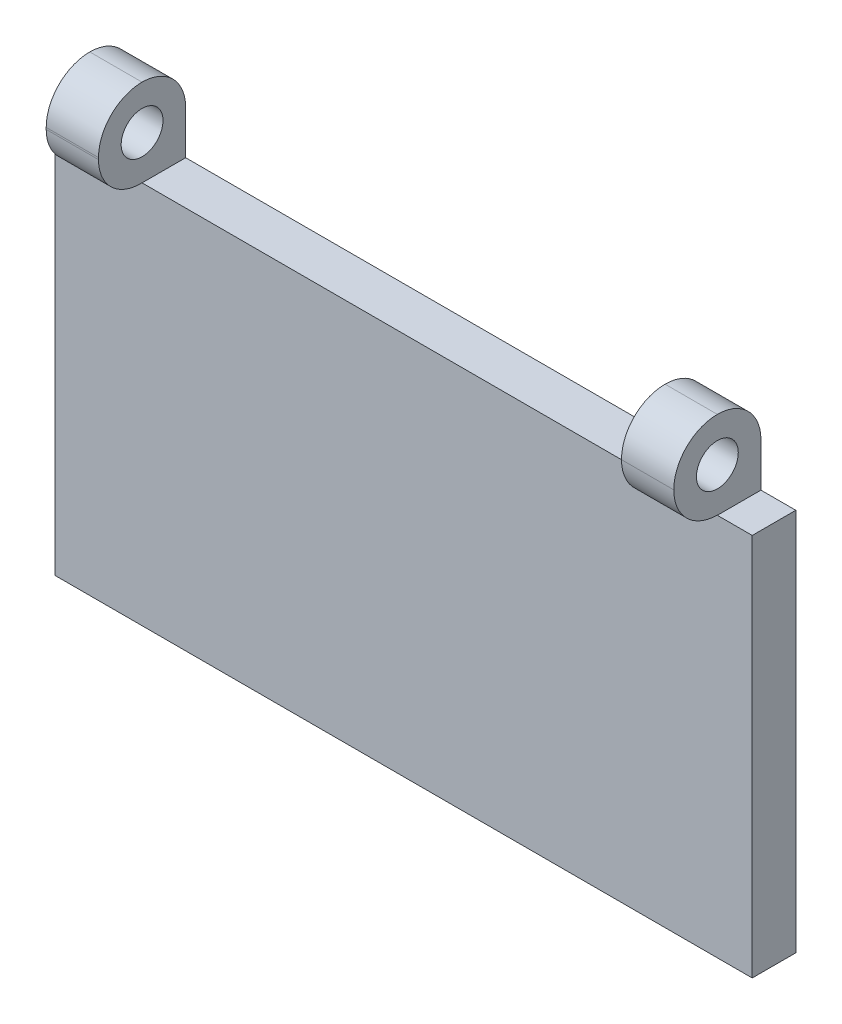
ISO-10303-21;
HEADER;
FILE_DESCRIPTION(('STEP AP214'),'2;1');
FILE_NAME('part.step','',(''),(''),'','','');
FILE_SCHEMA(('AUTOMOTIVE_DESIGN { 1 0 10303 214 1 1 1 1 }'));
ENDSEC;
DATA;
#1=APPLICATION_CONTEXT('core data for automotive mechanical design processes');
#2=APPLICATION_PROTOCOL_DEFINITION('international standard','automotive_design',2000,#1);
#3=PRODUCT_CONTEXT('',#1,'mechanical');
#4=PRODUCT('Part','Part','',(#3));
#5=PRODUCT_RELATED_PRODUCT_CATEGORY('part','',(#4));
#6=PRODUCT_DEFINITION_FORMATION('','',#4);
#7=PRODUCT_DEFINITION_CONTEXT('part definition',#1,'design');
#8=PRODUCT_DEFINITION('design','',#6,#7);
#9=PRODUCT_DEFINITION_SHAPE('','',#8);
#10=(LENGTH_UNIT() NAMED_UNIT(*) SI_UNIT(.MILLI.,.METRE.));
#11=(NAMED_UNIT(*) PLANE_ANGLE_UNIT() SI_UNIT($,.RADIAN.));
#12=(NAMED_UNIT(*) SI_UNIT($,.STERADIAN.) SOLID_ANGLE_UNIT());
#13=UNCERTAINTY_MEASURE_WITH_UNIT(LENGTH_MEASURE(1.E-05),#10,'distance_accuracy_value','');
#14=(GEOMETRIC_REPRESENTATION_CONTEXT(3) GLOBAL_UNCERTAINTY_ASSIGNED_CONTEXT((#13)) GLOBAL_UNIT_ASSIGNED_CONTEXT((#10,
#11,#12)) REPRESENTATION_CONTEXT('',''));
#15=CARTESIAN_POINT('',(0.,0.,0.));
#16=DIRECTION('',(0.,0.,1.));
#17=DIRECTION('',(1.,0.,0.));
#18=AXIS2_PLACEMENT_3D('',#15,#16,#17);
#19=CARTESIAN_POINT('',(18.,22.075,2.5));
#20=DIRECTION('',(-1.,0.,0.));
#21=DIRECTION('',(0.,0.,1.));
#22=AXIS2_PLACEMENT_3D('',#19,#20,#21);
#23=CYLINDRICAL_SURFACE('',#22,1.2);
#24=CARTESIAN_POINT('',(15.,22.075,2.5));
#25=DIRECTION('',(1.,0.,0.));
#26=DIRECTION('',(0.,0.,-1.));
#27=AXIS2_PLACEMENT_3D('',#24,#25,#26);
#28=CIRCLE('',#27,1.2);
#29=CARTESIAN_POINT('',(15.,22.075,1.3));
#30=VERTEX_POINT('',#29);
#31=EDGE_CURVE('E191',#30,#30,#28,.F.);
#32=ORIENTED_EDGE('',*,*,#31,.T.);
#33=EDGE_LOOP('',(#32));
#34=FACE_BOUND('',#33,.T.);
#35=CARTESIAN_POINT('',(18.,22.075,2.5));
#36=DIRECTION('',(1.,0.,0.));
#37=DIRECTION('',(0.,0.,-1.));
#38=AXIS2_PLACEMENT_3D('',#35,#36,#37);
#39=CIRCLE('',#38,1.2);
#40=CARTESIAN_POINT('',(18.,22.075,1.3));
#41=VERTEX_POINT('',#40);
#42=EDGE_CURVE('E301',#41,#41,#39,.F.);
#43=ORIENTED_EDGE('',*,*,#42,.F.);
#44=EDGE_LOOP('',(#43));
#45=FACE_BOUND('',#44,.T.);
#46=ADVANCED_FACE('F36',(#34,#45),#23,.F.);
#47=CARTESIAN_POINT('',(20.,22.075,2.5));
#48=DIRECTION('',(-1.,0.,0.));
#49=DIRECTION('',(0.,-1.,0.));
#50=AXIS2_PLACEMENT_3D('',#47,#48,#49);
#51=CYLINDRICAL_SURFACE('',#50,2.5);
#52=DIRECTION('',(-1.,0.,0.));
#53=VECTOR('',#52,1.);
#54=CARTESIAN_POINT('',(20.,24.575,2.5));
#55=LINE('',#54,#53);
#56=CARTESIAN_POINT('',(18.,24.575,2.5));
#57=VERTEX_POINT('',#56);
#58=CARTESIAN_POINT('',(15.,24.575,2.5));
#59=VERTEX_POINT('',#58);
#60=EDGE_CURVE('E228',#57,#59,#55,.T.);
#61=ORIENTED_EDGE('',*,*,#60,.F.);
#62=CARTESIAN_POINT('',(18.,22.075,2.5));
#63=DIRECTION('',(1.,0.,0.));
#64=DIRECTION('',(0.,0.,-1.));
#65=AXIS2_PLACEMENT_3D('',#62,#63,#64);
#66=CIRCLE('',#65,2.5);
#67=CARTESIAN_POINT('',(18.,22.075,0.));
#68=VERTEX_POINT('',#67);
#69=EDGE_CURVE('E312',#57,#68,#66,.F.);
#70=ORIENTED_EDGE('',*,*,#69,.T.);
#71=DIRECTION('',(-1.,0.,0.));
#72=VECTOR('',#71,1.);
#73=CARTESIAN_POINT('',(0.,22.075,0.));
#74=LINE('',#73,#72);
#75=CARTESIAN_POINT('',(15.,22.075,0.));
#76=VERTEX_POINT('',#75);
#77=EDGE_CURVE('E220',#76,#68,#74,.F.);
#78=ORIENTED_EDGE('',*,*,#77,.F.);
#79=CARTESIAN_POINT('',(15.,22.075,2.5));
#80=DIRECTION('',(1.,0.,0.));
#81=DIRECTION('',(0.,0.,-1.));
#82=AXIS2_PLACEMENT_3D('',#79,#80,#81);
#83=CIRCLE('',#82,2.5);
#84=EDGE_CURVE('E268',#59,#76,#83,.F.);
#85=ORIENTED_EDGE('',*,*,#84,.F.);
#86=EDGE_LOOP('',(#61,#70,#78,#85));
#87=FACE_BOUND('',#86,.T.);
#88=ADVANCED_FACE('F38',(#87),#51,.T.);
#89=CARTESIAN_POINT('',(20.,22.075,2.5));
#90=DIRECTION('',(-1.,0.,0.));
#91=DIRECTION('',(0.,-1.,0.));
#92=AXIS2_PLACEMENT_3D('',#89,#90,#91);
#93=CYLINDRICAL_SURFACE('',#92,2.5);
#94=DIRECTION('',(-1.,0.,0.));
#95=VECTOR('',#94,1.);
#96=CARTESIAN_POINT('',(20.,22.075,5.));
#97=LINE('',#96,#95);
#98=CARTESIAN_POINT('',(18.,22.075,5.));
#99=VERTEX_POINT('',#98);
#100=CARTESIAN_POINT('',(15.,22.075,5.));
#101=VERTEX_POINT('',#100);
#102=EDGE_CURVE('E229',#99,#101,#97,.T.);
#103=ORIENTED_EDGE('',*,*,#102,.F.);
#104=CARTESIAN_POINT('',(18.,22.075,2.5));
#105=DIRECTION('',(1.,0.,0.));
#106=DIRECTION('',(0.,0.,-1.));
#107=AXIS2_PLACEMENT_3D('',#104,#105,#106);
#108=CIRCLE('',#107,2.5);
#109=EDGE_CURVE('E315',#99,#57,#108,.F.);
#110=ORIENTED_EDGE('',*,*,#109,.T.);
#111=ORIENTED_EDGE('',*,*,#60,.T.);
#112=CARTESIAN_POINT('',(15.,22.075,2.5));
#113=DIRECTION('',(1.,0.,0.));
#114=DIRECTION('',(0.,0.,-1.));
#115=AXIS2_PLACEMENT_3D('',#112,#113,#114);
#116=CIRCLE('',#115,2.5);
#117=EDGE_CURVE('E197',#101,#59,#116,.F.);
#118=ORIENTED_EDGE('',*,*,#117,.F.);
#119=EDGE_LOOP('',(#103,#110,#111,#118));
#120=FACE_BOUND('',#119,.T.);
#121=ADVANCED_FACE('F423',(#120),#93,.T.);
#122=CARTESIAN_POINT('',(20.,22.075,2.5));
#123=DIRECTION('',(-1.,0.,0.));
#124=DIRECTION('',(0.,-1.,0.));
#125=AXIS2_PLACEMENT_3D('',#122,#123,#124);
#126=CYLINDRICAL_SURFACE('',#125,2.5);
#127=DIRECTION('',(-1.,0.,0.));
#128=VECTOR('',#127,1.);
#129=CARTESIAN_POINT('',(20.,19.575,2.5));
#130=LINE('',#129,#128);
#131=CARTESIAN_POINT('',(18.,19.575,2.5));
#132=VERTEX_POINT('',#131);
#133=CARTESIAN_POINT('',(15.,19.575,2.5));
#134=VERTEX_POINT('',#133);
#135=EDGE_CURVE('E253',#132,#134,#130,.T.);
#136=ORIENTED_EDGE('',*,*,#135,.F.);
#137=CARTESIAN_POINT('',(18.,22.075,2.5));
#138=DIRECTION('',(1.,0.,0.));
#139=DIRECTION('',(0.,0.,-1.));
#140=AXIS2_PLACEMENT_3D('',#137,#138,#139);
#141=CIRCLE('',#140,2.5);
#142=EDGE_CURVE('E212',#132,#99,#141,.F.);
#143=ORIENTED_EDGE('',*,*,#142,.T.);
#144=ORIENTED_EDGE('',*,*,#102,.T.);
#145=CARTESIAN_POINT('',(15.,22.075,2.5));
#146=DIRECTION('',(1.,0.,0.));
#147=DIRECTION('',(0.,0.,-1.));
#148=AXIS2_PLACEMENT_3D('',#145,#146,#147);
#149=CIRCLE('',#148,2.5);
#150=EDGE_CURVE('E208',#134,#101,#149,.F.);
#151=ORIENTED_EDGE('',*,*,#150,.F.);
#152=EDGE_LOOP('',(#136,#143,#144,#151));
#153=FACE_BOUND('',#152,.T.);
#154=ADVANCED_FACE('F428',(#153),#126,.T.);
#155=CARTESIAN_POINT('',(-18.,22.075,2.5));
#156=DIRECTION('',(1.,0.,0.));
#157=DIRECTION('',(0.,0.,-1.));
#158=AXIS2_PLACEMENT_3D('',#155,#156,#157);
#159=CIRCLE('',#158,1.2);
#160=CARTESIAN_POINT('',(-18.,22.075,1.3));
#161=VERTEX_POINT('',#160);
#162=EDGE_CURVE('E276',#161,#161,#159,.F.);
#163=ORIENTED_EDGE('',*,*,#162,.T.);
#164=EDGE_LOOP('',(#163));
#165=FACE_BOUND('',#164,.T.);
#166=CARTESIAN_POINT('',(-15.,22.075,2.5));
#167=DIRECTION('',(-1.,0.,0.));
#168=DIRECTION('',(0.,0.,1.));
#169=AXIS2_PLACEMENT_3D('',#166,#167,#168);
#170=CIRCLE('',#169,1.2);
#171=CARTESIAN_POINT('',(-15.,22.075,3.7));
#172=VERTEX_POINT('',#171);
#173=EDGE_CURVE('E231',#172,#172,#170,.F.);
#174=ORIENTED_EDGE('',*,*,#173,.T.);
#175=EDGE_LOOP('',(#174));
#176=FACE_BOUND('',#175,.T.);
#177=ADVANCED_FACE('F419',(#165,#176),#23,.F.);
#178=CARTESIAN_POINT('',(20.,-24.575,5.));
#179=DIRECTION('',(-1.,0.,0.));
#180=DIRECTION('',(0.,0.,1.));
#181=AXIS2_PLACEMENT_3D('',#178,#179,#180);
#182=PLANE('',#181);
#183=DIRECTION('',(0.,1.,0.));
#184=VECTOR('',#183,1.);
#185=CARTESIAN_POINT('',(20.,19.575,2.5));
#186=LINE('',#185,#184);
#187=CARTESIAN_POINT('',(20.,-2.4249997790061,2.5));
#188=VERTEX_POINT('',#187);
#189=CARTESIAN_POINT('',(20.,19.5610313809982,2.5));
#190=VERTEX_POINT('',#189);
#191=EDGE_CURVE('E248',#188,#190,#186,.T.);
#192=ORIENTED_EDGE('',*,*,#191,.F.);
#193=DIRECTION('',(0.,0.,-1.));
#194=VECTOR('',#193,1.);
#195=CARTESIAN_POINT('',(20.,-2.4249995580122,5.));
#196=LINE('',#195,#194);
#197=CARTESIAN_POINT('',(20.,-2.4249995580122,0.));
#198=VERTEX_POINT('',#197);
#199=EDGE_CURVE('E60',#188,#198,#196,.T.);
#200=ORIENTED_EDGE('',*,*,#199,.T.);
#201=DIRECTION('',(0.,1.,0.));
#202=VECTOR('',#201,1.);
#203=CARTESIAN_POINT('',(20.,-24.575,0.));
#204=LINE('',#203,#202);
#205=CARTESIAN_POINT('',(20.,19.5610313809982,0.));
#206=VERTEX_POINT('',#205);
#207=EDGE_CURVE('E237',#198,#206,#204,.T.);
#208=ORIENTED_EDGE('',*,*,#207,.T.);
#209=DIRECTION('',(0.,0.,-1.));
#210=VECTOR('',#209,1.);
#211=CARTESIAN_POINT('',(20.,19.5610313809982,0.));
#212=LINE('',#211,#210);
#213=EDGE_CURVE('E322',#190,#206,#212,.T.);
#214=ORIENTED_EDGE('',*,*,#213,.F.);
#215=EDGE_LOOP('',(#192,#200,#208,#214));
#216=FACE_BOUND('',#215,.T.);
#217=ADVANCED_FACE('F405',(#216),#182,.F.);
#218=CARTESIAN_POINT('',(-20.,-24.575,5.));
#219=DIRECTION('',(1.,0.,0.));
#220=DIRECTION('',(0.,0.,-1.));
#221=AXIS2_PLACEMENT_3D('',#218,#219,#220);
#222=PLANE('',#221);
#223=DIRECTION('',(0.,-1.,0.));
#224=VECTOR('',#223,1.);
#225=CARTESIAN_POINT('',(-20.,-24.575,0.));
#226=LINE('',#225,#224);
#227=CARTESIAN_POINT('',(-20.,19.5520831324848,0.));
#228=VERTEX_POINT('',#227);
#229=CARTESIAN_POINT('',(-19.9999997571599,-2.42500000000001,0.));
#230=VERTEX_POINT('',#229);
#231=EDGE_CURVE('E245',#228,#230,#226,.T.);
#232=ORIENTED_EDGE('',*,*,#231,.T.);
#233=DIRECTION('',(0.,0.,1.));
#234=VECTOR('',#233,1.);
#235=CARTESIAN_POINT('',(-19.9999997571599,-2.42500000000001,0.));
#236=LINE('',#235,#234);
#237=CARTESIAN_POINT('',(-19.9999997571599,-2.42500000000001,2.5));
#238=VERTEX_POINT('',#237);
#239=EDGE_CURVE('E329',#230,#238,#236,.T.);
#240=ORIENTED_EDGE('',*,*,#239,.T.);
#241=DIRECTION('',(0.,-1.,0.));
#242=VECTOR('',#241,1.);
#243=CARTESIAN_POINT('',(-19.9999995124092,19.575,2.5));
#244=LINE('',#243,#242);
#245=CARTESIAN_POINT('',(-20.,19.5520831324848,2.5));
#246=VERTEX_POINT('',#245);
#247=EDGE_CURVE('E250',#246,#238,#244,.T.);
#248=ORIENTED_EDGE('',*,*,#247,.F.);
#249=DIRECTION('',(0.,0.,1.));
#250=VECTOR('',#249,1.);
#251=CARTESIAN_POINT('',(-20.,19.5520831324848,0.));
#252=LINE('',#251,#250);
#253=EDGE_CURVE('E298',#228,#246,#252,.T.);
#254=ORIENTED_EDGE('',*,*,#253,.F.);
#255=EDGE_LOOP('',(#232,#240,#248,#254));
#256=FACE_BOUND('',#255,.T.);
#257=ADVANCED_FACE('F346',(#256),#222,.F.);
#258=CARTESIAN_POINT('',(0.,0.,0.));
#259=DIRECTION('',(0.,0.,1.));
#260=DIRECTION('',(1.,0.,0.));
#261=AXIS2_PLACEMENT_3D('',#258,#259,#260);
#262=PLANE('',#261);
#263=ORIENTED_EDGE('',*,*,#207,.F.);
#264=DIRECTION('',(-1.,-1.10496954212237E-08,0.));
#265=VECTOR('',#264,1.);
#266=CARTESIAN_POINT('',(-19.9999997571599,-2.42500000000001,0.));
#267=LINE('',#266,#265);
#268=EDGE_CURVE('E179',#198,#230,#267,.T.);
#269=ORIENTED_EDGE('',*,*,#268,.T.);
#270=ORIENTED_EDGE('',*,*,#231,.F.);
#271=DIRECTION('',(-1.,0.,0.));
#272=VECTOR('',#271,1.);
#273=CARTESIAN_POINT('',(-18.,19.5520831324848,0.));
#274=LINE('',#273,#272);
#275=CARTESIAN_POINT('',(-18.,19.5520831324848,0.));
#276=VERTEX_POINT('',#275);
#277=EDGE_CURVE('E294',#276,#228,#274,.T.);
#278=ORIENTED_EDGE('',*,*,#277,.F.);
#279=DIRECTION('',(0.,-1.,0.));
#280=VECTOR('',#279,1.);
#281=CARTESIAN_POINT('',(-18.,19.5520831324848,0.));
#282=LINE('',#281,#280);
#283=CARTESIAN_POINT('',(-18.,22.0799216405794,0.));
#284=VERTEX_POINT('',#283);
#285=EDGE_CURVE('E300',#284,#276,#282,.T.);
#286=ORIENTED_EDGE('',*,*,#285,.F.);
#287=DIRECTION('',(1.,0.,0.));
#288=VECTOR('',#287,1.);
#289=CARTESIAN_POINT('',(0.,22.0799216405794,0.));
#290=LINE('',#289,#288);
#291=CARTESIAN_POINT('',(-15.,22.0799216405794,0.));
#292=VERTEX_POINT('',#291);
#293=EDGE_CURVE('E217',#284,#292,#290,.T.);
#294=ORIENTED_EDGE('',*,*,#293,.T.);
#295=DIRECTION('',(0.,-1.,0.));
#296=VECTOR('',#295,1.);
#297=CARTESIAN_POINT('',(-15.,19.575,0.));
#298=LINE('',#297,#296);
#299=CARTESIAN_POINT('',(-15.,19.575,0.));
#300=VERTEX_POINT('',#299);
#301=EDGE_CURVE('E189',#292,#300,#298,.T.);
#302=ORIENTED_EDGE('',*,*,#301,.T.);
#303=DIRECTION('',(1.,0.,0.));
#304=VECTOR('',#303,1.);
#305=CARTESIAN_POINT('',(-15.,19.575,0.));
#306=LINE('',#305,#304);
#307=CARTESIAN_POINT('',(15.,19.575,0.));
#308=VERTEX_POINT('',#307);
#309=EDGE_CURVE('E275',#300,#308,#306,.T.);
#310=ORIENTED_EDGE('',*,*,#309,.T.);
#311=DIRECTION('',(0.,1.,0.));
#312=VECTOR('',#311,1.);
#313=CARTESIAN_POINT('',(15.,19.575,0.));
#314=LINE('',#313,#312);
#315=EDGE_CURVE('E278',#308,#76,#314,.T.);
#316=ORIENTED_EDGE('',*,*,#315,.T.);
#317=ORIENTED_EDGE('',*,*,#77,.T.);
#318=DIRECTION('',(0.,1.,0.));
#319=VECTOR('',#318,1.);
#320=CARTESIAN_POINT('',(18.,19.5610313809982,0.));
#321=LINE('',#320,#319);
#322=CARTESIAN_POINT('',(18.,19.5610313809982,0.));
#323=VERTEX_POINT('',#322);
#324=EDGE_CURVE('E325',#323,#68,#321,.T.);
#325=ORIENTED_EDGE('',*,*,#324,.F.);
#326=DIRECTION('',(1.,0.,0.));
#327=VECTOR('',#326,1.);
#328=CARTESIAN_POINT('',(18.,19.5610313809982,0.));
#329=LINE('',#328,#327);
#330=EDGE_CURVE('E318',#323,#206,#329,.T.);
#331=ORIENTED_EDGE('',*,*,#330,.T.);
#332=EDGE_LOOP('',(#263,#269,#270,#278,#286,#294,#302,#310,#316,#317,#325,#331));
#333=FACE_BOUND('',#332,.T.);
#334=ADVANCED_FACE('F342',(#333),#262,.F.);
#335=CARTESIAN_POINT('',(0.,0.,2.5));
#336=DIRECTION('',(0.,0.,1.));
#337=DIRECTION('',(1.,0.,0.));
#338=AXIS2_PLACEMENT_3D('',#335,#336,#337);
#339=PLANE('',#338);
#340=DIRECTION('',(-1.,-1.10496954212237E-08,0.));
#341=VECTOR('',#340,1.);
#342=CARTESIAN_POINT('',(2.67955089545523E-08,-2.42499977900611,2.5));
#343=LINE('',#342,#341);
#344=EDGE_CURVE('E12',#188,#238,#343,.T.);
#345=ORIENTED_EDGE('',*,*,#344,.F.);
#346=ORIENTED_EDGE('',*,*,#191,.T.);
#347=DIRECTION('',(1.,0.,0.));
#348=VECTOR('',#347,1.);
#349=CARTESIAN_POINT('',(0.,19.5610313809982,2.5));
#350=LINE('',#349,#348);
#351=CARTESIAN_POINT('',(18.,19.5610313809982,2.5));
#352=VERTEX_POINT('',#351);
#353=EDGE_CURVE('E45',#352,#190,#350,.T.);
#354=ORIENTED_EDGE('',*,*,#353,.F.);
#355=DIRECTION('',(0.,1.,0.));
#356=VECTOR('',#355,1.);
#357=CARTESIAN_POINT('',(18.,0.,2.5));
#358=LINE('',#357,#356);
#359=EDGE_CURVE('E309',#352,#132,#358,.T.);
#360=ORIENTED_EDGE('',*,*,#359,.T.);
#361=ORIENTED_EDGE('',*,*,#135,.T.);
#362=CARTESIAN_POINT('',(-15.,19.575,2.5));
#363=VERTEX_POINT('',#362);
#364=EDGE_CURVE('E255',#134,#363,#130,.T.);
#365=ORIENTED_EDGE('',*,*,#364,.T.);
#366=DIRECTION('',(0.,-1.,0.));
#367=VECTOR('',#366,1.);
#368=CARTESIAN_POINT('',(-15.,0.,2.5));
#369=LINE('',#368,#367);
#370=CARTESIAN_POINT('',(-15.,19.5799216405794,2.5));
#371=VERTEX_POINT('',#370);
#372=EDGE_CURVE('E260',#371,#363,#369,.T.);
#373=ORIENTED_EDGE('',*,*,#372,.F.);
#374=DIRECTION('',(-1.,0.,0.));
#375=VECTOR('',#374,1.);
#376=CARTESIAN_POINT('',(-20.,19.5799216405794,2.5));
#377=LINE('',#376,#375);
#378=CARTESIAN_POINT('',(-18.,19.5799216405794,2.5));
#379=VERTEX_POINT('',#378);
#380=EDGE_CURVE('E227',#371,#379,#377,.T.);
#381=ORIENTED_EDGE('',*,*,#380,.T.);
#382=DIRECTION('',(0.,1.,0.));
#383=VECTOR('',#382,1.);
#384=CARTESIAN_POINT('',(-18.,0.,2.5));
#385=LINE('',#384,#383);
#386=CARTESIAN_POINT('',(-18.,19.5520831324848,2.5));
#387=VERTEX_POINT('',#386);
#388=EDGE_CURVE('E285',#387,#379,#385,.T.);
#389=ORIENTED_EDGE('',*,*,#388,.F.);
#390=DIRECTION('',(1.,0.,0.));
#391=VECTOR('',#390,1.);
#392=CARTESIAN_POINT('',(0.,19.5520831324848,2.5));
#393=LINE('',#392,#391);
#394=EDGE_CURVE('E215',#246,#387,#393,.T.);
#395=ORIENTED_EDGE('',*,*,#394,.F.);
#396=ORIENTED_EDGE('',*,*,#247,.T.);
#397=EDGE_LOOP('',(#345,#346,#354,#360,#361,#365,#373,#381,#389,#395,#396));
#398=FACE_BOUND('',#397,.T.);
#399=ADVANCED_FACE('F354',(#398),#339,.T.);
#400=CARTESIAN_POINT('',(-20.,19.5799216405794,0.));
#401=DIRECTION('',(0.,1.,0.));
#402=DIRECTION('',(-1.,0.,0.));
#403=AXIS2_PLACEMENT_3D('',#400,#401,#402);
#404=PLANE('',#403);
#405=DIRECTION('',(1.,0.,0.));
#406=VECTOR('',#405,1.);
#407=CARTESIAN_POINT('',(-20.,19.5799216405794,2.6));
#408=LINE('',#407,#406);
#409=CARTESIAN_POINT('',(-15.,19.5799216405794,2.6));
#410=VERTEX_POINT('',#409);
#411=CARTESIAN_POINT('',(-18.,19.5799216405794,2.6));
#412=VERTEX_POINT('',#411);
#413=EDGE_CURVE('E240',#410,#412,#408,.F.);
#414=ORIENTED_EDGE('',*,*,#413,.T.);
#415=DIRECTION('',(0.,0.,-1.));
#416=VECTOR('',#415,1.);
#417=CARTESIAN_POINT('',(-18.,19.5799216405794,0.));
#418=LINE('',#417,#416);
#419=EDGE_CURVE('E287',#412,#379,#418,.T.);
#420=ORIENTED_EDGE('',*,*,#419,.T.);
#421=ORIENTED_EDGE('',*,*,#380,.F.);
#422=DIRECTION('',(0.,0.,1.));
#423=VECTOR('',#422,1.);
#424=CARTESIAN_POINT('',(-15.,19.5799216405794,0.));
#425=LINE('',#424,#423);
#426=EDGE_CURVE('E262',#371,#410,#425,.T.);
#427=ORIENTED_EDGE('',*,*,#426,.T.);
#428=EDGE_LOOP('',(#414,#420,#421,#427));
#429=FACE_BOUND('',#428,.T.);
#430=ADVANCED_FACE('F362',(#429),#404,.F.);
#431=CARTESIAN_POINT('',(-20.,19.5799216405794,5.));
#432=DIRECTION('',(0.,0.,-1.));
#433=DIRECTION('',(-1.,0.,0.));
#434=AXIS2_PLACEMENT_3D('',#431,#432,#433);
#435=PLANE('',#434);
#436=DIRECTION('',(1.,0.,0.));
#437=VECTOR('',#436,1.);
#438=CARTESIAN_POINT('',(-20.,22.0799216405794,5.));
#439=LINE('',#438,#437);
#440=CARTESIAN_POINT('',(-15.,22.0799216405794,5.));
#441=VERTEX_POINT('',#440);
#442=CARTESIAN_POINT('',(-18.,22.0799216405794,5.));
#443=VERTEX_POINT('',#442);
#444=EDGE_CURVE('E234',#441,#443,#439,.F.);
#445=ORIENTED_EDGE('',*,*,#444,.T.);
#446=DIRECTION('',(0.,1.,0.));
#447=VECTOR('',#446,1.);
#448=CARTESIAN_POINT('',(-18.,19.5520831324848,5.));
#449=LINE('',#448,#447);
#450=CARTESIAN_POINT('',(-18.,21.9799216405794,5.));
#451=VERTEX_POINT('',#450);
#452=EDGE_CURVE('E297',#451,#443,#449,.T.);
#453=ORIENTED_EDGE('',*,*,#452,.F.);
#454=DIRECTION('',(1.,0.,0.));
#455=VECTOR('',#454,1.);
#456=CARTESIAN_POINT('',(-20.,21.9799216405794,5.));
#457=LINE('',#456,#455);
#458=CARTESIAN_POINT('',(-15.,21.9799216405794,5.));
#459=VERTEX_POINT('',#458);
#460=EDGE_CURVE('E236',#451,#459,#457,.T.);
#461=ORIENTED_EDGE('',*,*,#460,.T.);
#462=DIRECTION('',(0.,-1.,0.));
#463=VECTOR('',#462,1.);
#464=CARTESIAN_POINT('',(-15.,19.575,5.));
#465=LINE('',#464,#463);
#466=EDGE_CURVE('E272',#441,#459,#465,.T.);
#467=ORIENTED_EDGE('',*,*,#466,.F.);
#468=EDGE_LOOP('',(#445,#453,#461,#467));
#469=FACE_BOUND('',#468,.T.);
#470=ADVANCED_FACE('F372',(#469),#435,.F.);
#471=CARTESIAN_POINT('',(-20.,21.9799216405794,2.6));
#472=DIRECTION('',(1.,0.,0.));
#473=DIRECTION('',(0.,1.,0.));
#474=AXIS2_PLACEMENT_3D('',#471,#472,#473);
#475=CYLINDRICAL_SURFACE('',#474,2.4);
#476=CARTESIAN_POINT('',(-18.,21.9799216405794,2.6));
#477=DIRECTION('',(1.,0.,0.));
#478=DIRECTION('',(0.,0.,-1.));
#479=AXIS2_PLACEMENT_3D('',#476,#477,#478);
#480=CIRCLE('',#479,2.4);
#481=EDGE_CURVE('E290',#412,#451,#480,.F.);
#482=ORIENTED_EDGE('',*,*,#481,.F.);
#483=ORIENTED_EDGE('',*,*,#413,.F.);
#484=CARTESIAN_POINT('',(-15.,21.9799216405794,2.6));
#485=DIRECTION('',(-1.,0.,0.));
#486=DIRECTION('',(0.,0.,1.));
#487=AXIS2_PLACEMENT_3D('',#484,#485,#486);
#488=CIRCLE('',#487,2.4);
#489=EDGE_CURVE('E190',#459,#410,#488,.F.);
#490=ORIENTED_EDGE('',*,*,#489,.F.);
#491=ORIENTED_EDGE('',*,*,#460,.F.);
#492=EDGE_LOOP('',(#482,#483,#490,#491));
#493=FACE_BOUND('',#492,.T.);
#494=ADVANCED_FACE('F366',(#493),#475,.T.);
#495=CARTESIAN_POINT('',(0.,22.0799216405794,2.5));
#496=DIRECTION('',(1.,0.,0.));
#497=DIRECTION('',(0.,1.,0.));
#498=AXIS2_PLACEMENT_3D('',#495,#496,#497);
#499=CYLINDRICAL_SURFACE('',#498,2.5);
#500=CARTESIAN_POINT('',(-14.9999620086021,22.0799216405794,2.5));
#501=DIRECTION('',(-1.,0.,0.));
#502=DIRECTION('',(0.,-1.,0.));
#503=AXIS2_PLACEMENT_3D('',#500,#501,#502);
#504=CIRCLE('',#503,2.5);
#505=CARTESIAN_POINT('',(-14.9999645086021,24.575,2.34320720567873));
#506=VERTEX_POINT('',#505);
#507=CARTESIAN_POINT('',(-14.9999620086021,24.5799216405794,2.5));
#508=VERTEX_POINT('',#507);
#509=EDGE_CURVE('E166',#506,#508,#504,.F.);
#510=ORIENTED_EDGE('',*,*,#509,.F.);
#511=CARTESIAN_POINT('',(-15.,22.0799216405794,2.5));
#512=DIRECTION('',(-1.,0.,0.));
#513=DIRECTION('',(0.,0.,1.));
#514=AXIS2_PLACEMENT_3D('',#511,#512,#513);
#515=CIRCLE('',#514,2.5);
#516=EDGE_CURVE('E176',#292,#506,#515,.F.);
#517=ORIENTED_EDGE('',*,*,#516,.F.);
#518=ORIENTED_EDGE('',*,*,#293,.F.);
#519=CARTESIAN_POINT('',(-18.,22.0799216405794,2.5));
#520=DIRECTION('',(1.,0.,0.));
#521=DIRECTION('',(0.,0.,-1.));
#522=AXIS2_PLACEMENT_3D('',#519,#520,#521);
#523=CIRCLE('',#522,2.5);
#524=CARTESIAN_POINT('',(-18.,24.5799216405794,2.5));
#525=VERTEX_POINT('',#524);
#526=EDGE_CURVE('E292',#525,#284,#523,.F.);
#527=ORIENTED_EDGE('',*,*,#526,.F.);
#528=DIRECTION('',(1.,0.,0.));
#529=VECTOR('',#528,1.);
#530=CARTESIAN_POINT('',(-20.,24.5799216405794,2.5));
#531=LINE('',#530,#529);
#532=EDGE_CURVE('E178',#508,#525,#531,.F.);
#533=ORIENTED_EDGE('',*,*,#532,.F.);
#534=EDGE_LOOP('',(#510,#517,#518,#527,#533));
#535=FACE_BOUND('',#534,.T.);
#536=ADVANCED_FACE('F174',(#535),#499,.T.);
#537=CARTESIAN_POINT('',(-20.,22.0799216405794,2.5));
#538=DIRECTION('',(1.,0.,0.));
#539=DIRECTION('',(0.,1.,0.));
#540=AXIS2_PLACEMENT_3D('',#537,#538,#539);
#541=CYLINDRICAL_SURFACE('',#540,2.5);
#542=CARTESIAN_POINT('',(-14.9999620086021,22.0799216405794,2.5));
#543=DIRECTION('',(-1.,0.,0.));
#544=DIRECTION('',(0.,-1.,0.));
#545=AXIS2_PLACEMENT_3D('',#542,#543,#544);
#546=CIRCLE('',#545,2.5);
#547=CARTESIAN_POINT('',(-14.9999645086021,24.575,2.65679279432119));
#548=VERTEX_POINT('',#547);
#549=EDGE_CURVE('E53',#508,#548,#546,.F.);
#550=ORIENTED_EDGE('',*,*,#549,.F.);
#551=ORIENTED_EDGE('',*,*,#532,.T.);
#552=CARTESIAN_POINT('',(-18.,22.0799216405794,2.5));
#553=DIRECTION('',(1.,0.,0.));
#554=DIRECTION('',(0.,0.,-1.));
#555=AXIS2_PLACEMENT_3D('',#552,#553,#554);
#556=CIRCLE('',#555,2.5);
#557=EDGE_CURVE('E207',#443,#525,#556,.F.);
#558=ORIENTED_EDGE('',*,*,#557,.F.);
#559=ORIENTED_EDGE('',*,*,#444,.F.);
#560=CARTESIAN_POINT('',(-15.,22.0799216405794,2.5));
#561=DIRECTION('',(-1.,0.,0.));
#562=DIRECTION('',(0.,0.,1.));
#563=AXIS2_PLACEMENT_3D('',#560,#561,#562);
#564=CIRCLE('',#563,2.5);
#565=EDGE_CURVE('E206',#548,#441,#564,.F.);
#566=ORIENTED_EDGE('',*,*,#565,.F.);
#567=EDGE_LOOP('',(#550,#551,#558,#559,#566));
#568=FACE_BOUND('',#567,.T.);
#569=ADVANCED_FACE('F376',(#568),#541,.T.);
#570=CARTESIAN_POINT('',(-15.,19.575,0.));
#571=DIRECTION('',(-1.,0.,0.));
#572=DIRECTION('',(0.,0.,1.));
#573=AXIS2_PLACEMENT_3D('',#570,#571,#572);
#574=PLANE('',#573);
#575=ORIENTED_EDGE('',*,*,#372,.T.);
#576=DIRECTION('',(0.,0.,1.));
#577=VECTOR('',#576,1.);
#578=CARTESIAN_POINT('',(-15.,19.575,0.));
#579=LINE('',#578,#577);
#580=EDGE_CURVE('E193',#300,#363,#579,.T.);
#581=ORIENTED_EDGE('',*,*,#580,.F.);
#582=ORIENTED_EDGE('',*,*,#301,.F.);
#583=ORIENTED_EDGE('',*,*,#516,.T.);
#584=DIRECTION('',(0.,0.,1.));
#585=VECTOR('',#584,1.);
#586=CARTESIAN_POINT('',(-15.,24.575,0.));
#587=LINE('',#586,#585);
#588=EDGE_CURVE('E187',#506,#548,#587,.T.);
#589=ORIENTED_EDGE('',*,*,#588,.T.);
#590=ORIENTED_EDGE('',*,*,#565,.T.);
#591=ORIENTED_EDGE('',*,*,#466,.T.);
#592=ORIENTED_EDGE('',*,*,#489,.T.);
#593=ORIENTED_EDGE('',*,*,#426,.F.);
#594=EDGE_LOOP('',(#575,#581,#582,#583,#589,#590,#591,#592,#593));
#595=FACE_BOUND('',#594,.T.);
#596=ORIENTED_EDGE('',*,*,#173,.F.);
#597=EDGE_LOOP('',(#596));
#598=FACE_BOUND('',#597,.T.);
#599=ADVANCED_FACE('F185',(#595,#598),#574,.F.);
#600=CARTESIAN_POINT('',(-15.,24.575,0.));
#601=DIRECTION('',(0.,1.,0.));
#602=DIRECTION('',(-1.,0.,0.));
#603=AXIS2_PLACEMENT_3D('',#600,#601,#602);
#604=PLANE('',#603);
#605=ORIENTED_EDGE('',*,*,#588,.F.);
#606=DIRECTION('',(0.,0.,-1.));
#607=VECTOR('',#606,1.);
#608=CARTESIAN_POINT('',(-14.9999620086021,24.575,2.65679279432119));
#609=LINE('',#608,#607);
#610=EDGE_CURVE('E163',#548,#506,#609,.T.);
#611=ORIENTED_EDGE('',*,*,#610,.F.);
#612=EDGE_LOOP('',(#605,#611));
#613=FACE_BOUND('',#612,.T.);
#614=ADVANCED_FACE('F192',(#613),#604,.F.);
#615=CARTESIAN_POINT('',(15.,19.575,0.));
#616=DIRECTION('',(1.,0.,0.));
#617=DIRECTION('',(0.,0.,-1.));
#618=AXIS2_PLACEMENT_3D('',#615,#616,#617);
#619=PLANE('',#618);
#620=ORIENTED_EDGE('',*,*,#84,.T.);
#621=ORIENTED_EDGE('',*,*,#315,.F.);
#622=DIRECTION('',(0.,0.,1.));
#623=VECTOR('',#622,1.);
#624=CARTESIAN_POINT('',(15.,19.575,0.));
#625=LINE('',#624,#623);
#626=EDGE_CURVE('E194',#308,#134,#625,.T.);
#627=ORIENTED_EDGE('',*,*,#626,.T.);
#628=ORIENTED_EDGE('',*,*,#150,.T.);
#629=ORIENTED_EDGE('',*,*,#117,.T.);
#630=EDGE_LOOP('',(#620,#621,#627,#628,#629));
#631=FACE_BOUND('',#630,.T.);
#632=ORIENTED_EDGE('',*,*,#31,.F.);
#633=EDGE_LOOP('',(#632));
#634=FACE_BOUND('',#633,.T.);
#635=ADVANCED_FACE('F387',(#631,#634),#619,.F.);
#636=CARTESIAN_POINT('',(-15.,19.575,0.));
#637=DIRECTION('',(0.,-1.,0.));
#638=DIRECTION('',(1.,0.,0.));
#639=AXIS2_PLACEMENT_3D('',#636,#637,#638);
#640=PLANE('',#639);
#641=ORIENTED_EDGE('',*,*,#580,.T.);
#642=ORIENTED_EDGE('',*,*,#364,.F.);
#643=ORIENTED_EDGE('',*,*,#626,.F.);
#644=ORIENTED_EDGE('',*,*,#309,.F.);
#645=EDGE_LOOP('',(#641,#642,#643,#644));
#646=FACE_BOUND('',#645,.T.);
#647=ADVANCED_FACE('F383',(#646),#640,.F.);
#648=CARTESIAN_POINT('',(-18.,0.,0.));
#649=DIRECTION('',(1.,0.,0.));
#650=DIRECTION('',(0.,0.,-1.));
#651=AXIS2_PLACEMENT_3D('',#648,#649,#650);
#652=PLANE('',#651);
#653=ORIENTED_EDGE('',*,*,#388,.T.);
#654=ORIENTED_EDGE('',*,*,#419,.F.);
#655=ORIENTED_EDGE('',*,*,#481,.T.);
#656=ORIENTED_EDGE('',*,*,#452,.T.);
#657=ORIENTED_EDGE('',*,*,#557,.T.);
#658=ORIENTED_EDGE('',*,*,#526,.T.);
#659=ORIENTED_EDGE('',*,*,#285,.T.);
#660=DIRECTION('',(0.,0.,1.));
#661=VECTOR('',#660,1.);
#662=CARTESIAN_POINT('',(-18.,19.5520831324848,0.));
#663=LINE('',#662,#661);
#664=EDGE_CURVE('E303',#276,#387,#663,.T.);
#665=ORIENTED_EDGE('',*,*,#664,.T.);
#666=EDGE_LOOP('',(#653,#654,#655,#656,#657,#658,#659,#665));
#667=FACE_BOUND('',#666,.T.);
#668=ORIENTED_EDGE('',*,*,#162,.F.);
#669=EDGE_LOOP('',(#668));
#670=FACE_BOUND('',#669,.T.);
#671=ADVANCED_FACE('F358',(#667,#670),#652,.F.);
#672=CARTESIAN_POINT('',(-18.,19.5520831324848,0.));
#673=DIRECTION('',(0.,-1.,0.));
#674=DIRECTION('',(0.,0.,-1.));
#675=AXIS2_PLACEMENT_3D('',#672,#673,#674);
#676=PLANE('',#675);
#677=ORIENTED_EDGE('',*,*,#394,.T.);
#678=ORIENTED_EDGE('',*,*,#664,.F.);
#679=ORIENTED_EDGE('',*,*,#277,.T.);
#680=ORIENTED_EDGE('',*,*,#253,.T.);
#681=EDGE_LOOP('',(#677,#678,#679,#680));
#682=FACE_BOUND('',#681,.T.);
#683=ADVANCED_FACE('F350',(#682),#676,.F.);
#684=CARTESIAN_POINT('',(18.,0.,0.));
#685=DIRECTION('',(1.,0.,0.));
#686=DIRECTION('',(0.,0.,-1.));
#687=AXIS2_PLACEMENT_3D('',#684,#685,#686);
#688=PLANE('',#687);
#689=DIRECTION('',(0.,0.,-1.));
#690=VECTOR('',#689,1.);
#691=CARTESIAN_POINT('',(18.,19.5610313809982,0.));
#692=LINE('',#691,#690);
#693=EDGE_CURVE('E321',#352,#323,#692,.T.);
#694=ORIENTED_EDGE('',*,*,#693,.T.);
#695=ORIENTED_EDGE('',*,*,#324,.T.);
#696=ORIENTED_EDGE('',*,*,#69,.F.);
#697=ORIENTED_EDGE('',*,*,#109,.F.);
#698=ORIENTED_EDGE('',*,*,#142,.F.);
#699=ORIENTED_EDGE('',*,*,#359,.F.);
#700=EDGE_LOOP('',(#694,#695,#696,#697,#698,#699));
#701=FACE_BOUND('',#700,.T.);
#702=ORIENTED_EDGE('',*,*,#42,.T.);
#703=EDGE_LOOP('',(#702));
#704=FACE_BOUND('',#703,.T.);
#705=ADVANCED_FACE('F396',(#701,#704),#688,.T.);
#706=CARTESIAN_POINT('',(18.,19.5610313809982,0.));
#707=DIRECTION('',(0.,-1.,0.));
#708=DIRECTION('',(0.,0.,-1.));
#709=AXIS2_PLACEMENT_3D('',#706,#707,#708);
#710=PLANE('',#709);
#711=ORIENTED_EDGE('',*,*,#353,.T.);
#712=ORIENTED_EDGE('',*,*,#213,.T.);
#713=ORIENTED_EDGE('',*,*,#330,.F.);
#714=ORIENTED_EDGE('',*,*,#693,.F.);
#715=EDGE_LOOP('',(#711,#712,#713,#714));
#716=FACE_BOUND('',#715,.T.);
#717=ADVANCED_FACE('F401',(#716),#710,.F.);
#718=CARTESIAN_POINT('',(-19.9999997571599,-2.42500000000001,0.));
#719=DIRECTION('',(-1.10496954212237E-08,1.,0.));
#720=DIRECTION('',(-1.,-1.10496954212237E-08,0.));
#721=AXIS2_PLACEMENT_3D('',#718,#719,#720);
#722=PLANE('',#721);
#723=ORIENTED_EDGE('',*,*,#344,.T.);
#724=ORIENTED_EDGE('',*,*,#239,.F.);
#725=ORIENTED_EDGE('',*,*,#268,.F.);
#726=ORIENTED_EDGE('',*,*,#199,.F.);
#727=EDGE_LOOP('',(#723,#724,#725,#726));
#728=FACE_BOUND('',#727,.T.);
#729=ADVANCED_FACE('F406',(#728),#722,.F.);
#730=CARTESIAN_POINT('',(-14.9999620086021,24.625,2.65679279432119));
#731=DIRECTION('',(-1.,0.,0.));
#732=DIRECTION('',(0.,-1.,0.));
#733=AXIS2_PLACEMENT_3D('',#730,#731,#732);
#734=PLANE('',#733);
#735=ORIENTED_EDGE('',*,*,#509,.T.);
#736=ORIENTED_EDGE('',*,*,#549,.T.);
#737=ORIENTED_EDGE('',*,*,#610,.T.);
#738=EDGE_LOOP('',(#735,#736,#737));
#739=FACE_BOUND('',#738,.T.);
#740=ADVANCED_FACE('F165',(#739),#734,.F.);
#741=CLOSED_SHELL('',(#46,#88,#121,#154,#177,#217,#257,#334,#399,#430,#470,#494,#536,#569,#599,
#614,#635,#647,#671,#683,#705,#717,#729,#740));
#742=MANIFOLD_SOLID_BREP('B2',#741);
#743=ADVANCED_BREP_SHAPE_REPRESENTATION('',(#18,#742),#14);
#744=SHAPE_DEFINITION_REPRESENTATION(#9,#743);
ENDSEC;
END-ISO-10303-21;
